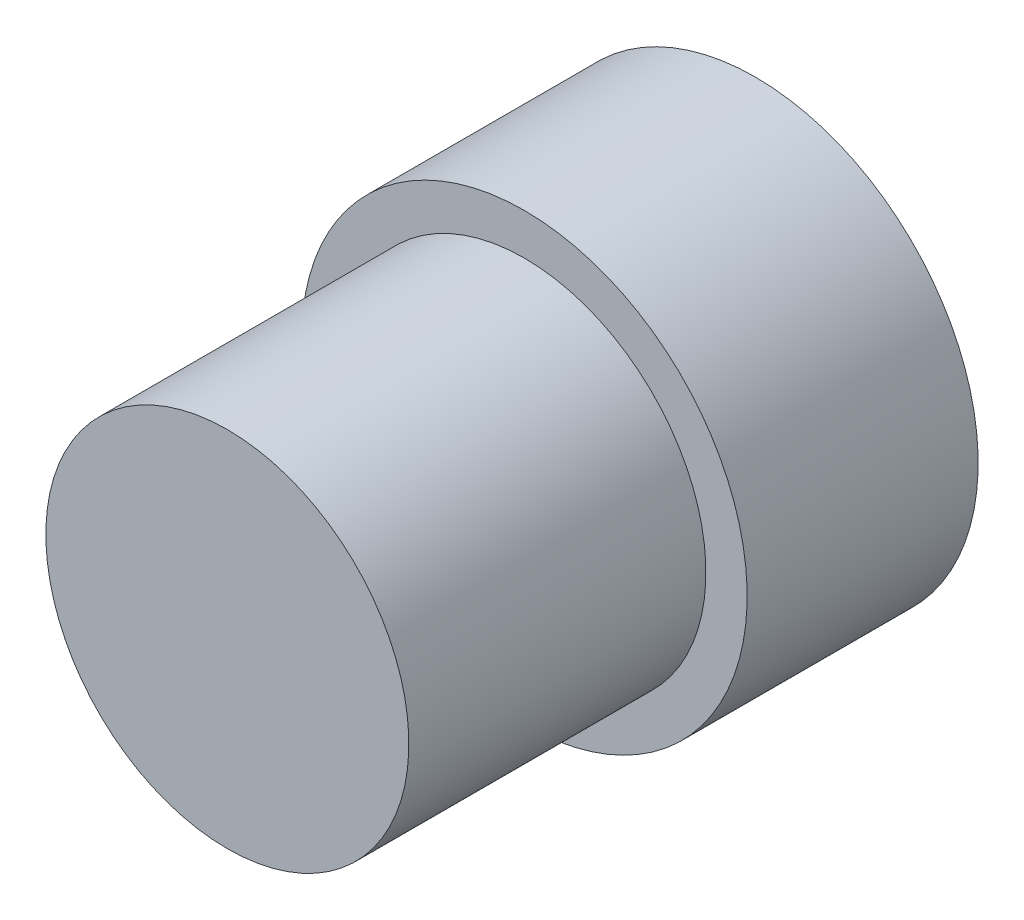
ISO-10303-21;
HEADER;
FILE_DESCRIPTION(('STEP AP214'),'2;1');
FILE_NAME('part.step','',(''),(''),'','','');
FILE_SCHEMA(('AUTOMOTIVE_DESIGN { 1 0 10303 214 1 1 1 1 }'));
ENDSEC;
DATA;
#1=APPLICATION_CONTEXT('core data for automotive mechanical design processes');
#2=APPLICATION_PROTOCOL_DEFINITION('international standard','automotive_design',2000,#1);
#3=PRODUCT_CONTEXT('',#1,'mechanical');
#4=PRODUCT('Part','Part','',(#3));
#5=PRODUCT_RELATED_PRODUCT_CATEGORY('part','',(#4));
#6=PRODUCT_DEFINITION_FORMATION('','',#4);
#7=PRODUCT_DEFINITION_CONTEXT('part definition',#1,'design');
#8=PRODUCT_DEFINITION('design','',#6,#7);
#9=PRODUCT_DEFINITION_SHAPE('','',#8);
#10=(LENGTH_UNIT() NAMED_UNIT(*) SI_UNIT(.MILLI.,.METRE.));
#11=(NAMED_UNIT(*) PLANE_ANGLE_UNIT() SI_UNIT($,.RADIAN.));
#12=(NAMED_UNIT(*) SI_UNIT($,.STERADIAN.) SOLID_ANGLE_UNIT());
#13=UNCERTAINTY_MEASURE_WITH_UNIT(LENGTH_MEASURE(1.E-05),#10,'distance_accuracy_value','');
#14=(GEOMETRIC_REPRESENTATION_CONTEXT(3) GLOBAL_UNCERTAINTY_ASSIGNED_CONTEXT((#13)) GLOBAL_UNIT_ASSIGNED_CONTEXT((#10,
#11,#12)) REPRESENTATION_CONTEXT('',''));
#15=CARTESIAN_POINT('',(0.,0.,0.));
#16=DIRECTION('',(0.,0.,1.));
#17=DIRECTION('',(1.,0.,0.));
#18=AXIS2_PLACEMENT_3D('',#15,#16,#17);
#19=CARTESIAN_POINT('',(0.,0.,0.));
#20=DIRECTION('',(0.,0.,-1.));
#21=DIRECTION('',(0.,-1.,0.));
#22=AXIS2_PLACEMENT_3D('',#19,#20,#21);
#23=CYLINDRICAL_SURFACE('',#22,5.);
#24=CARTESIAN_POINT('',(0.,0.,0.));
#25=DIRECTION('',(0.,0.,1.));
#26=DIRECTION('',(0.,-1.,0.));
#27=AXIS2_PLACEMENT_3D('',#24,#25,#26);
#28=CIRCLE('',#27,5.);
#29=CARTESIAN_POINT('',(0.,-5.,0.));
#30=VERTEX_POINT('',#29);
#31=EDGE_CURVE('E8',#30,#30,#28,.T.);
#32=ORIENTED_EDGE('',*,*,#31,.F.);
#33=EDGE_LOOP('',(#32));
#34=FACE_BOUND('',#33,.T.);
#35=CARTESIAN_POINT('',(0.,0.,14.));
#36=DIRECTION('',(0.,0.,1.));
#37=DIRECTION('',(0.,-1.,0.));
#38=AXIS2_PLACEMENT_3D('',#35,#36,#37);
#39=CIRCLE('',#38,5.);
#40=CARTESIAN_POINT('',(0.,-5.,14.));
#41=VERTEX_POINT('',#40);
#42=EDGE_CURVE('E59',#41,#41,#39,.T.);
#43=ORIENTED_EDGE('',*,*,#42,.T.);
#44=EDGE_LOOP('',(#43));
#45=FACE_BOUND('',#44,.T.);
#46=ADVANCED_FACE('F12',(#34,#45),#23,.F.);
#47=CARTESIAN_POINT('',(5.,0.,32.));
#48=DIRECTION('',(0.,0.,1.));
#49=DIRECTION('',(0.,1.,0.));
#50=AXIS2_PLACEMENT_3D('',#47,#48,#49);
#51=PLANE('',#50);
#52=CARTESIAN_POINT('',(0.,0.,32.));
#53=DIRECTION('',(0.,0.,1.));
#54=DIRECTION('',(0.,-1.,0.));
#55=AXIS2_PLACEMENT_3D('',#52,#53,#54);
#56=CIRCLE('',#55,11.);
#57=CARTESIAN_POINT('',(0.,-11.,32.));
#58=VERTEX_POINT('',#57);
#59=EDGE_CURVE('E19',#58,#58,#56,.T.);
#60=ORIENTED_EDGE('',*,*,#59,.T.);
#61=EDGE_LOOP('',(#60));
#62=FACE_BOUND('',#61,.T.);
#63=ADVANCED_FACE('F77',(#62),#51,.T.);
#64=CARTESIAN_POINT('',(5.,0.,0.));
#65=DIRECTION('',(0.,0.,-1.));
#66=DIRECTION('',(0.,-1.,0.));
#67=AXIS2_PLACEMENT_3D('',#64,#65,#66);
#68=PLANE('',#67);
#69=CARTESIAN_POINT('',(0.,-9.,0.));
#70=DIRECTION('',(0.,0.,1.));
#71=DIRECTION('',(0.,-1.,0.));
#72=AXIS2_PLACEMENT_3D('',#69,#70,#71);
#73=CIRCLE('',#72,2.);
#74=CARTESIAN_POINT('',(0.,-11.,0.));
#75=VERTEX_POINT('',#74);
#76=EDGE_CURVE('E53',#75,#75,#73,.T.);
#77=ORIENTED_EDGE('',*,*,#76,.T.);
#78=EDGE_LOOP('',(#77));
#79=FACE_BOUND('',#78,.T.);
#80=CARTESIAN_POINT('',(-9.,0.,0.));
#81=DIRECTION('',(0.,0.,1.));
#82=DIRECTION('',(0.,-1.,0.));
#83=AXIS2_PLACEMENT_3D('',#80,#81,#82);
#84=CIRCLE('',#83,2.);
#85=CARTESIAN_POINT('',(-9.,-2.00000000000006,0.));
#86=VERTEX_POINT('',#85);
#87=EDGE_CURVE('E47',#86,#86,#84,.T.);
#88=ORIENTED_EDGE('',*,*,#87,.T.);
#89=EDGE_LOOP('',(#88));
#90=FACE_BOUND('',#89,.T.);
#91=CARTESIAN_POINT('',(0.,9.,0.));
#92=DIRECTION('',(0.,0.,1.));
#93=DIRECTION('',(0.,-1.,0.));
#94=AXIS2_PLACEMENT_3D('',#91,#92,#93);
#95=CIRCLE('',#94,2.);
#96=CARTESIAN_POINT('',(0.,7.,0.));
#97=VERTEX_POINT('',#96);
#98=EDGE_CURVE('E41',#97,#97,#95,.T.);
#99=ORIENTED_EDGE('',*,*,#98,.T.);
#100=EDGE_LOOP('',(#99));
#101=FACE_BOUND('',#100,.T.);
#102=CARTESIAN_POINT('',(9.,0.,0.));
#103=DIRECTION('',(0.,0.,1.));
#104=DIRECTION('',(0.,-1.,0.));
#105=AXIS2_PLACEMENT_3D('',#102,#103,#104);
#106=CIRCLE('',#105,2.);
#107=CARTESIAN_POINT('',(9.,-2.,0.));
#108=VERTEX_POINT('',#107);
#109=EDGE_CURVE('E35',#108,#108,#106,.T.);
#110=ORIENTED_EDGE('',*,*,#109,.T.);
#111=EDGE_LOOP('',(#110));
#112=FACE_BOUND('',#111,.T.);
#113=CARTESIAN_POINT('',(0.,0.,0.));
#114=DIRECTION('',(0.,0.,1.));
#115=DIRECTION('',(0.,-1.,0.));
#116=AXIS2_PLACEMENT_3D('',#113,#114,#115);
#117=CIRCLE('',#116,13.5);
#118=CARTESIAN_POINT('',(0.,-13.5,0.));
#119=VERTEX_POINT('',#118);
#120=EDGE_CURVE('E32',#119,#119,#117,.T.);
#121=ORIENTED_EDGE('',*,*,#120,.F.);
#122=EDGE_LOOP('',(#121));
#123=FACE_BOUND('',#122,.T.);
#124=ORIENTED_EDGE('',*,*,#31,.T.);
#125=EDGE_LOOP('',(#124));
#126=FACE_BOUND('',#125,.T.);
#127=ADVANCED_FACE('F14',(#79,#90,#101,#112,#123,#126),#68,.T.);
#128=CARTESIAN_POINT('',(0.,0.,0.));
#129=DIRECTION('',(0.,0.,-1.));
#130=DIRECTION('',(0.,-1.,0.));
#131=AXIS2_PLACEMENT_3D('',#128,#129,#130);
#132=CYLINDRICAL_SURFACE('',#131,11.);
#133=ORIENTED_EDGE('',*,*,#59,.F.);
#134=EDGE_LOOP('',(#133));
#135=FACE_BOUND('',#134,.T.);
#136=CARTESIAN_POINT('',(0.,0.,14.));
#137=DIRECTION('',(0.,0.,1.));
#138=DIRECTION('',(0.,-1.,0.));
#139=AXIS2_PLACEMENT_3D('',#136,#137,#138);
#140=CIRCLE('',#139,11.);
#141=CARTESIAN_POINT('',(0.,-11.,14.));
#142=VERTEX_POINT('',#141);
#143=EDGE_CURVE('E23',#142,#142,#140,.T.);
#144=ORIENTED_EDGE('',*,*,#143,.T.);
#145=EDGE_LOOP('',(#144));
#146=FACE_BOUND('',#145,.T.);
#147=ADVANCED_FACE('F85',(#135,#146),#132,.T.);
#148=CARTESIAN_POINT('',(11.,0.,14.));
#149=DIRECTION('',(0.,0.,1.));
#150=DIRECTION('',(0.,1.,0.));
#151=AXIS2_PLACEMENT_3D('',#148,#149,#150);
#152=PLANE('',#151);
#153=ORIENTED_EDGE('',*,*,#143,.F.);
#154=EDGE_LOOP('',(#153));
#155=FACE_BOUND('',#154,.T.);
#156=CARTESIAN_POINT('',(0.,0.,14.));
#157=DIRECTION('',(0.,0.,1.));
#158=DIRECTION('',(0.,-1.,0.));
#159=AXIS2_PLACEMENT_3D('',#156,#157,#158);
#160=CIRCLE('',#159,13.5);
#161=CARTESIAN_POINT('',(0.,-13.5,14.));
#162=VERTEX_POINT('',#161);
#163=EDGE_CURVE('E27',#162,#162,#160,.T.);
#164=ORIENTED_EDGE('',*,*,#163,.T.);
#165=EDGE_LOOP('',(#164));
#166=FACE_BOUND('',#165,.T.);
#167=ADVANCED_FACE('F88',(#155,#166),#152,.T.);
#168=CARTESIAN_POINT('',(0.,0.,0.));
#169=DIRECTION('',(0.,0.,-1.));
#170=DIRECTION('',(0.,-1.,0.));
#171=AXIS2_PLACEMENT_3D('',#168,#169,#170);
#172=CYLINDRICAL_SURFACE('',#171,13.5);
#173=ORIENTED_EDGE('',*,*,#163,.F.);
#174=EDGE_LOOP('',(#173));
#175=FACE_BOUND('',#174,.T.);
#176=ORIENTED_EDGE('',*,*,#120,.T.);
#177=EDGE_LOOP('',(#176));
#178=FACE_BOUND('',#177,.T.);
#179=ADVANCED_FACE('F92',(#175,#178),#172,.T.);
#180=CARTESIAN_POINT('',(9.,0.,0.));
#181=DIRECTION('',(0.,0.,-1.));
#182=DIRECTION('',(0.,-1.,0.));
#183=AXIS2_PLACEMENT_3D('',#180,#181,#182);
#184=CYLINDRICAL_SURFACE('',#183,2.);
#185=CARTESIAN_POINT('',(9.,0.,8.));
#186=DIRECTION('',(0.,0.,1.));
#187=DIRECTION('',(0.,-1.,0.));
#188=AXIS2_PLACEMENT_3D('',#185,#186,#187);
#189=CIRCLE('',#188,2.);
#190=CARTESIAN_POINT('',(9.,-2.,8.));
#191=VERTEX_POINT('',#190);
#192=EDGE_CURVE('E38',#191,#191,#189,.T.);
#193=ORIENTED_EDGE('',*,*,#192,.T.);
#194=EDGE_LOOP('',(#193));
#195=FACE_BOUND('',#194,.T.);
#196=ORIENTED_EDGE('',*,*,#109,.F.);
#197=EDGE_LOOP('',(#196));
#198=FACE_BOUND('',#197,.T.);
#199=ADVANCED_FACE('F96',(#195,#198),#184,.F.);
#200=CARTESIAN_POINT('',(10.65,0.,8.));
#201=DIRECTION('',(0.,0.,1.));
#202=DIRECTION('',(0.,1.,0.));
#203=AXIS2_PLACEMENT_3D('',#200,#201,#202);
#204=PLANE('',#203);
#205=ORIENTED_EDGE('',*,*,#192,.F.);
#206=EDGE_LOOP('',(#205));
#207=FACE_BOUND('',#206,.T.);
#208=ADVANCED_FACE('F100',(#207),#204,.F.);
#209=CARTESIAN_POINT('',(0.,9.,0.));
#210=DIRECTION('',(0.,0.,-1.));
#211=DIRECTION('',(0.,-1.,0.));
#212=AXIS2_PLACEMENT_3D('',#209,#210,#211);
#213=CYLINDRICAL_SURFACE('',#212,2.);
#214=CARTESIAN_POINT('',(0.,9.,8.));
#215=DIRECTION('',(0.,0.,1.));
#216=DIRECTION('',(0.,-1.,0.));
#217=AXIS2_PLACEMENT_3D('',#214,#215,#216);
#218=CIRCLE('',#217,2.);
#219=CARTESIAN_POINT('',(0.,7.,8.));
#220=VERTEX_POINT('',#219);
#221=EDGE_CURVE('E44',#220,#220,#218,.T.);
#222=ORIENTED_EDGE('',*,*,#221,.T.);
#223=EDGE_LOOP('',(#222));
#224=FACE_BOUND('',#223,.T.);
#225=ORIENTED_EDGE('',*,*,#98,.F.);
#226=EDGE_LOOP('',(#225));
#227=FACE_BOUND('',#226,.T.);
#228=ADVANCED_FACE('F104',(#224,#227),#213,.F.);
#229=CARTESIAN_POINT('',(1.64999999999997,9.,8.));
#230=DIRECTION('',(0.,0.,1.));
#231=DIRECTION('',(0.,1.,0.));
#232=AXIS2_PLACEMENT_3D('',#229,#230,#231);
#233=PLANE('',#232);
#234=ORIENTED_EDGE('',*,*,#221,.F.);
#235=EDGE_LOOP('',(#234));
#236=FACE_BOUND('',#235,.T.);
#237=ADVANCED_FACE('F108',(#236),#233,.F.);
#238=CARTESIAN_POINT('',(-9.,0.,0.));
#239=DIRECTION('',(0.,0.,-1.));
#240=DIRECTION('',(0.,-1.,0.));
#241=AXIS2_PLACEMENT_3D('',#238,#239,#240);
#242=CYLINDRICAL_SURFACE('',#241,2.);
#243=CARTESIAN_POINT('',(-9.,0.,8.));
#244=DIRECTION('',(0.,0.,1.));
#245=DIRECTION('',(0.,-1.,0.));
#246=AXIS2_PLACEMENT_3D('',#243,#244,#245);
#247=CIRCLE('',#246,2.);
#248=CARTESIAN_POINT('',(-9.,-2.00000000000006,8.));
#249=VERTEX_POINT('',#248);
#250=EDGE_CURVE('E50',#249,#249,#247,.T.);
#251=ORIENTED_EDGE('',*,*,#250,.T.);
#252=EDGE_LOOP('',(#251));
#253=FACE_BOUND('',#252,.T.);
#254=ORIENTED_EDGE('',*,*,#87,.F.);
#255=EDGE_LOOP('',(#254));
#256=FACE_BOUND('',#255,.T.);
#257=ADVANCED_FACE('F112',(#253,#256),#242,.F.);
#258=CARTESIAN_POINT('',(-7.35,0.,8.));
#259=DIRECTION('',(0.,0.,1.));
#260=DIRECTION('',(0.,1.,0.));
#261=AXIS2_PLACEMENT_3D('',#258,#259,#260);
#262=PLANE('',#261);
#263=ORIENTED_EDGE('',*,*,#250,.F.);
#264=EDGE_LOOP('',(#263));
#265=FACE_BOUND('',#264,.T.);
#266=ADVANCED_FACE('F116',(#265),#262,.F.);
#267=CARTESIAN_POINT('',(0.,-9.,0.));
#268=DIRECTION('',(0.,0.,-1.));
#269=DIRECTION('',(0.,-1.,0.));
#270=AXIS2_PLACEMENT_3D('',#267,#268,#269);
#271=CYLINDRICAL_SURFACE('',#270,2.);
#272=CARTESIAN_POINT('',(0.,-9.,8.));
#273=DIRECTION('',(0.,0.,1.));
#274=DIRECTION('',(0.,-1.,0.));
#275=AXIS2_PLACEMENT_3D('',#272,#273,#274);
#276=CIRCLE('',#275,2.);
#277=CARTESIAN_POINT('',(0.,-11.,8.));
#278=VERTEX_POINT('',#277);
#279=EDGE_CURVE('E56',#278,#278,#276,.T.);
#280=ORIENTED_EDGE('',*,*,#279,.T.);
#281=EDGE_LOOP('',(#280));
#282=FACE_BOUND('',#281,.T.);
#283=ORIENTED_EDGE('',*,*,#76,.F.);
#284=EDGE_LOOP('',(#283));
#285=FACE_BOUND('',#284,.T.);
#286=ADVANCED_FACE('F73',(#282,#285),#271,.F.);
#287=CARTESIAN_POINT('',(1.65000000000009,-9.,8.));
#288=DIRECTION('',(0.,0.,1.));
#289=DIRECTION('',(0.,1.,0.));
#290=AXIS2_PLACEMENT_3D('',#287,#288,#289);
#291=PLANE('',#290);
#292=ORIENTED_EDGE('',*,*,#279,.F.);
#293=EDGE_LOOP('',(#292));
#294=FACE_BOUND('',#293,.T.);
#295=ADVANCED_FACE('F66',(#294),#291,.F.);
#296=CARTESIAN_POINT('',(11.,0.,14.));
#297=DIRECTION('',(0.,0.,1.));
#298=DIRECTION('',(0.,1.,0.));
#299=AXIS2_PLACEMENT_3D('',#296,#297,#298);
#300=PLANE('',#299);
#301=ORIENTED_EDGE('',*,*,#42,.F.);
#302=EDGE_LOOP('',(#301));
#303=FACE_BOUND('',#302,.T.);
#304=ADVANCED_FACE('F64',(#303),#300,.F.);
#305=CLOSED_SHELL('',(#46,#63,#127,#147,#167,#179,#199,#208,#228,#237,#257,#266,#286,#295,#304));
#306=MANIFOLD_SOLID_BREP('B1',#305);
#307=ADVANCED_BREP_SHAPE_REPRESENTATION('',(#18,#306),#14);
#308=SHAPE_DEFINITION_REPRESENTATION(#9,#307);
ENDSEC;
END-ISO-10303-21;
